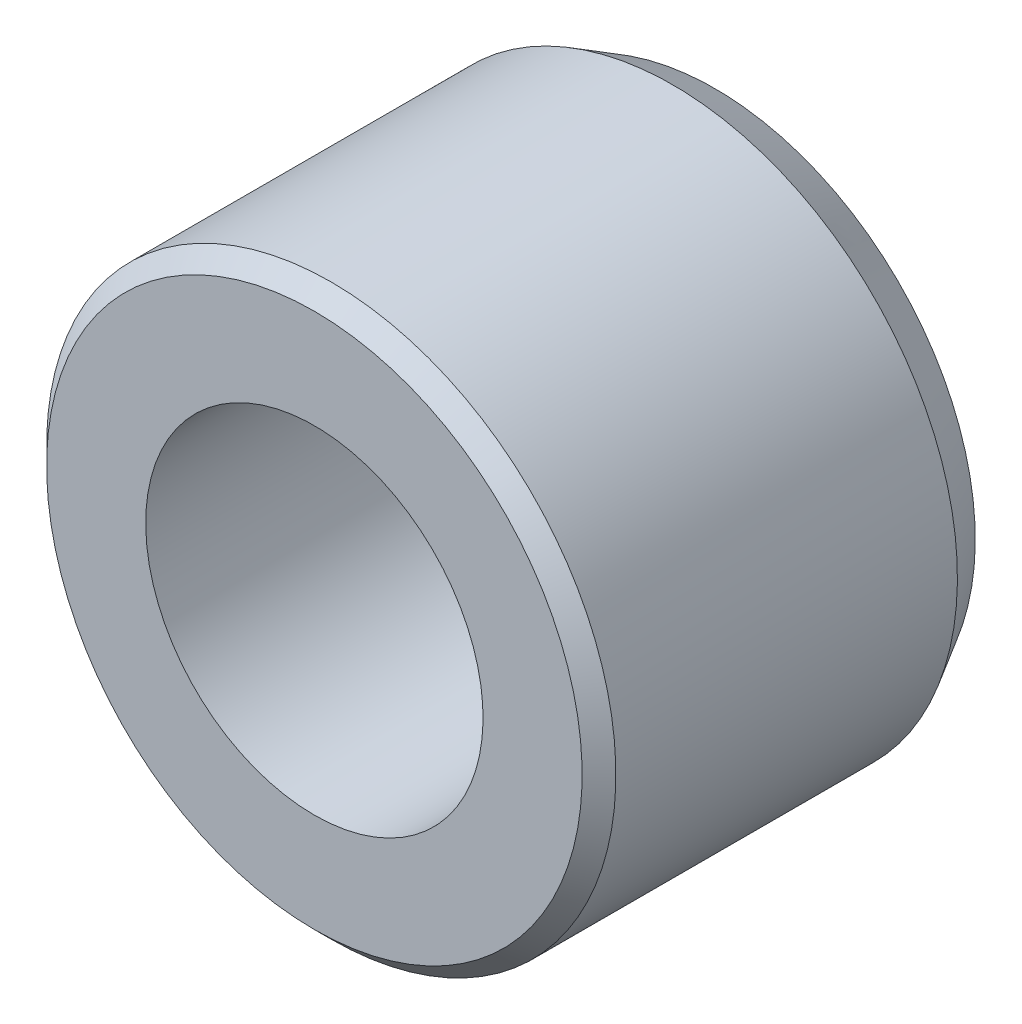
ISO-10303-21;
HEADER;
FILE_DESCRIPTION(('STEP AP214'),'2;1');
FILE_NAME('part.step','',(''),(''),'','','');
FILE_SCHEMA(('AUTOMOTIVE_DESIGN { 1 0 10303 214 1 1 1 1 }'));
ENDSEC;
DATA;
#1=APPLICATION_CONTEXT('core data for automotive mechanical design processes');
#2=APPLICATION_PROTOCOL_DEFINITION('international standard','automotive_design',2000,#1);
#3=PRODUCT_CONTEXT('',#1,'mechanical');
#4=PRODUCT('Part','Part','',(#3));
#5=PRODUCT_RELATED_PRODUCT_CATEGORY('part','',(#4));
#6=PRODUCT_DEFINITION_FORMATION('','',#4);
#7=PRODUCT_DEFINITION_CONTEXT('part definition',#1,'design');
#8=PRODUCT_DEFINITION('design','',#6,#7);
#9=PRODUCT_DEFINITION_SHAPE('','',#8);
#10=(LENGTH_UNIT() NAMED_UNIT(*) SI_UNIT(.MILLI.,.METRE.));
#11=(NAMED_UNIT(*) PLANE_ANGLE_UNIT() SI_UNIT($,.RADIAN.));
#12=(NAMED_UNIT(*) SI_UNIT($,.STERADIAN.) SOLID_ANGLE_UNIT());
#13=UNCERTAINTY_MEASURE_WITH_UNIT(LENGTH_MEASURE(1.E-05),#10,'distance_accuracy_value','');
#14=(GEOMETRIC_REPRESENTATION_CONTEXT(3) GLOBAL_UNCERTAINTY_ASSIGNED_CONTEXT((#13)) GLOBAL_UNIT_ASSIGNED_CONTEXT((#10,
#11,#12)) REPRESENTATION_CONTEXT('',''));
#15=CARTESIAN_POINT('',(0.,0.,0.));
#16=DIRECTION('',(0.,0.,1.));
#17=DIRECTION('',(1.,0.,0.));
#18=AXIS2_PLACEMENT_3D('',#15,#16,#17);
#19=CARTESIAN_POINT('',(0.,0.,-9.5));
#20=DIRECTION('',(0.,0.,1.));
#21=DIRECTION('',(0.,-1.,0.));
#22=AXIS2_PLACEMENT_3D('',#19,#20,#21);
#23=CYLINDRICAL_SURFACE('',#22,4.);
#24=CARTESIAN_POINT('',(0.,0.,0.));
#25=DIRECTION('',(0.,0.,1.));
#26=DIRECTION('',(0.,-1.,0.));
#27=AXIS2_PLACEMENT_3D('',#24,#25,#26);
#28=CIRCLE('',#27,4.);
#29=CARTESIAN_POINT('',(0.,-4.,0.));
#30=VERTEX_POINT('',#29);
#31=EDGE_CURVE('E15',#30,#30,#28,.F.);
#32=ORIENTED_EDGE('',*,*,#31,.F.);
#33=EDGE_LOOP('',(#32));
#34=FACE_BOUND('',#33,.T.);
#35=CARTESIAN_POINT('',(0.,0.,-9.5));
#36=DIRECTION('',(0.,0.,1.));
#37=DIRECTION('',(0.,-1.,0.));
#38=AXIS2_PLACEMENT_3D('',#35,#36,#37);
#39=CIRCLE('',#38,4.);
#40=CARTESIAN_POINT('',(0.,-4.,-9.5));
#41=VERTEX_POINT('',#40);
#42=EDGE_CURVE('E35',#41,#41,#39,.T.);
#43=ORIENTED_EDGE('',*,*,#42,.F.);
#44=EDGE_LOOP('',(#43));
#45=FACE_BOUND('',#44,.T.);
#46=ADVANCED_FACE('F12',(#34,#45),#23,.F.);
#47=CARTESIAN_POINT('',(6.35,0.,0.));
#48=DIRECTION('',(0.,0.,1.));
#49=DIRECTION('',(0.,-1.,0.));
#50=AXIS2_PLACEMENT_3D('',#47,#48,#49);
#51=PLANE('',#50);
#52=CARTESIAN_POINT('',(0.,0.,2.72872002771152E-12));
#53=DIRECTION('',(0.,0.,-1.));
#54=DIRECTION('',(0.,1.,0.));
#55=AXIS2_PLACEMENT_3D('',#52,#53,#54);
#56=CIRCLE('',#55,6.34999999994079);
#57=CARTESIAN_POINT('',(0.,6.34999999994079,2.72872002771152E-12));
#58=VERTEX_POINT('',#57);
#59=EDGE_CURVE('E33',#58,#58,#56,.T.);
#60=ORIENTED_EDGE('',*,*,#59,.F.);
#61=EDGE_LOOP('',(#60));
#62=FACE_BOUND('',#61,.T.);
#63=ORIENTED_EDGE('',*,*,#31,.T.);
#64=EDGE_LOOP('',(#63));
#65=FACE_BOUND('',#64,.T.);
#66=ADVANCED_FACE('F42',(#62,#65),#51,.T.);
#67=CARTESIAN_POINT('',(4.,0.,-9.5));
#68=DIRECTION('',(0.,0.,-1.));
#69=DIRECTION('',(0.,1.,0.));
#70=AXIS2_PLACEMENT_3D('',#67,#68,#69);
#71=PLANE('',#70);
#72=ORIENTED_EDGE('',*,*,#42,.T.);
#73=EDGE_LOOP('',(#72));
#74=FACE_BOUND('',#73,.T.);
#75=CARTESIAN_POINT('',(0.,0.,-9.50000000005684));
#76=DIRECTION('',(0.,0.,1.));
#77=DIRECTION('',(0.,-1.,0.));
#78=AXIS2_PLACEMENT_3D('',#75,#76,#77);
#79=CIRCLE('',#78,6.17264973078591);
#80=CARTESIAN_POINT('',(0.,-6.17264973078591,-9.50000000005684));
#81=VERTEX_POINT('',#80);
#82=EDGE_CURVE('E24',#81,#81,#79,.T.);
#83=ORIENTED_EDGE('',*,*,#82,.F.);
#84=EDGE_LOOP('',(#83));
#85=FACE_BOUND('',#84,.T.);
#86=ADVANCED_FACE('F50',(#74,#85),#71,.T.);
#87=CARTESIAN_POINT('',(0.,0.,-0.399999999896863));
#88=DIRECTION('',(0.,0.,-1.));
#89=DIRECTION('',(0.,1.,0.));
#90=AXIS2_PLACEMENT_3D('',#87,#88,#89);
#91=CONICAL_SURFACE('',#90,6.74999999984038,0.785398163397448);
#92=CARTESIAN_POINT('',(0.,0.,-0.4));
#93=DIRECTION('',(0.,0.,1.));
#94=DIRECTION('',(0.,-1.,0.));
#95=AXIS2_PLACEMENT_3D('',#92,#93,#94);
#96=CIRCLE('',#95,6.75);
#97=CARTESIAN_POINT('',(0.,-6.75,-0.4));
#98=VERTEX_POINT('',#97);
#99=EDGE_CURVE('E19',#98,#98,#96,.F.);
#100=ORIENTED_EDGE('',*,*,#99,.F.);
#101=EDGE_LOOP('',(#100));
#102=FACE_BOUND('',#101,.T.);
#103=ORIENTED_EDGE('',*,*,#59,.T.);
#104=EDGE_LOOP('',(#103));
#105=FACE_BOUND('',#104,.T.);
#106=ADVANCED_FACE('F59',(#102,#105),#91,.T.);
#107=CARTESIAN_POINT('',(0.,0.,-8.50000000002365));
#108=DIRECTION('',(0.,0.,1.));
#109=DIRECTION('',(0.,-1.,0.));
#110=AXIS2_PLACEMENT_3D('',#107,#108,#109);
#111=CONICAL_SURFACE('',#110,6.75000000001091,0.523598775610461);
#112=ORIENTED_EDGE('',*,*,#82,.T.);
#113=EDGE_LOOP('',(#112));
#114=FACE_BOUND('',#113,.T.);
#115=CARTESIAN_POINT('',(0.,0.,-8.5));
#116=DIRECTION('',(0.,0.,1.));
#117=DIRECTION('',(0.,-1.,0.));
#118=AXIS2_PLACEMENT_3D('',#115,#116,#117);
#119=CIRCLE('',#118,6.75);
#120=CARTESIAN_POINT('',(0.,-6.75,-8.5));
#121=VERTEX_POINT('',#120);
#122=EDGE_CURVE('E8',#121,#121,#119,.T.);
#123=ORIENTED_EDGE('',*,*,#122,.F.);
#124=EDGE_LOOP('',(#123));
#125=FACE_BOUND('',#124,.T.);
#126=ADVANCED_FACE('F54',(#114,#125),#111,.T.);
#127=CARTESIAN_POINT('',(0.,0.,-9.5));
#128=DIRECTION('',(0.,0.,1.));
#129=DIRECTION('',(0.,-1.,0.));
#130=AXIS2_PLACEMENT_3D('',#127,#128,#129);
#131=CYLINDRICAL_SURFACE('',#130,6.75);
#132=ORIENTED_EDGE('',*,*,#122,.T.);
#133=EDGE_LOOP('',(#132));
#134=FACE_BOUND('',#133,.T.);
#135=ORIENTED_EDGE('',*,*,#99,.T.);
#136=EDGE_LOOP('',(#135));
#137=FACE_BOUND('',#136,.T.);
#138=ADVANCED_FACE('F52',(#134,#137),#131,.T.);
#139=CLOSED_SHELL('',(#46,#66,#86,#106,#126,#138));
#140=MANIFOLD_SOLID_BREP('B1',#139);
#141=ADVANCED_BREP_SHAPE_REPRESENTATION('',(#18,#140),#14);
#142=SHAPE_DEFINITION_REPRESENTATION(#9,#141);
ENDSEC;
END-ISO-10303-21;
